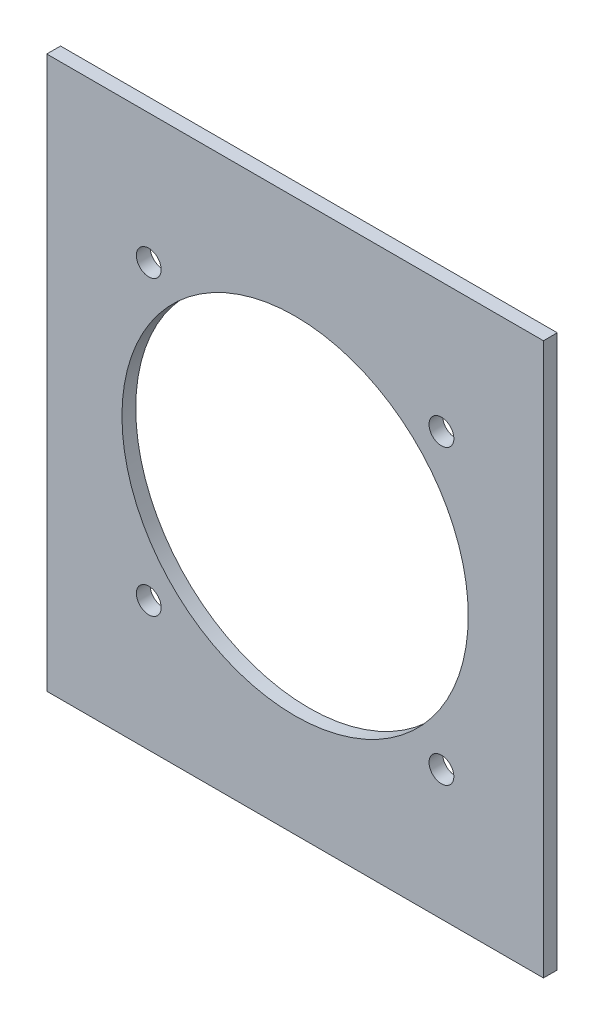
from build123d import *

# Parameters (mm, degrees)
ESQUISSE1_W      = 360
ESQUISSE1_H      = 400
ESQUISSE1_R      = 125.5
ESQUISSE1_R_2    = 9
EXTRUSION1_DEPTH = 10


with BuildPart() as part:
    # Esquisse1 → Extrusion1 (new body)
    with BuildSketch(Plane.XY):
        Rectangle(ESQUISSE1_W, ESQUISSE1_H)
        Circle(ESQUISSE1_R, mode=Mode.SUBTRACT)
        with Locations((106.066017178, 106.066017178)):
            Circle(ESQUISSE1_R_2, mode=Mode.SUBTRACT)
        with Locations((-106.066017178, 106.066017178)):
            Circle(ESQUISSE1_R_2, mode=Mode.SUBTRACT)
        with Locations((-106.066017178, -106.066017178)):
            Circle(ESQUISSE1_R_2, mode=Mode.SUBTRACT)
        with Locations((106.066017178, -106.066017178)):
            Circle(ESQUISSE1_R_2, mode=Mode.SUBTRACT)
    extrude(amount=EXTRUSION1_DEPTH)


solid = part.part
